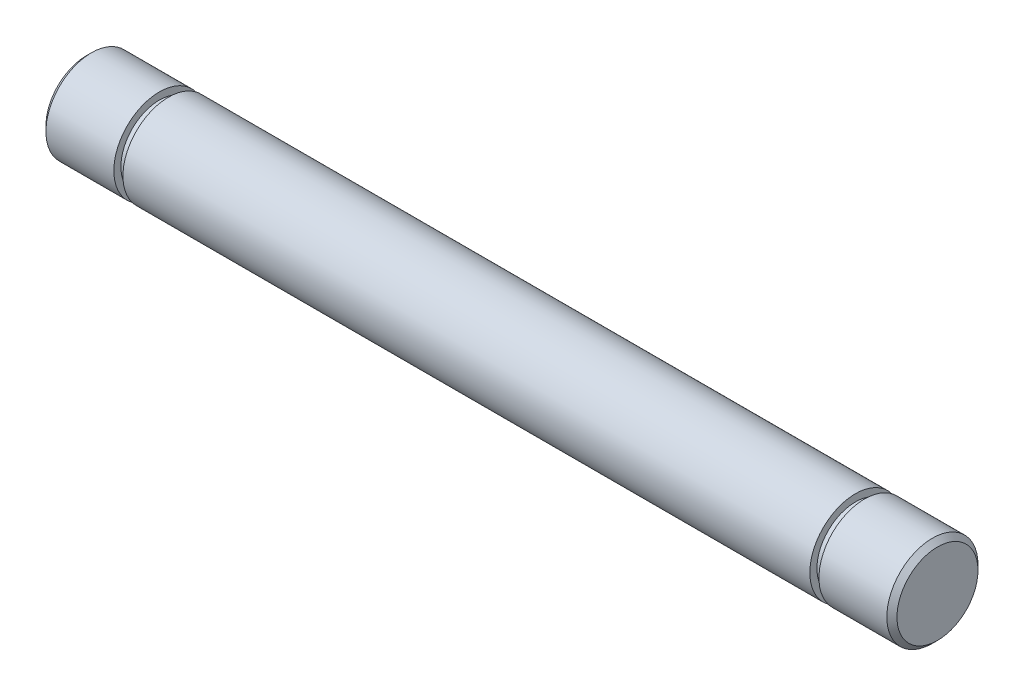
from build123d import *


with BuildPart() as part:
    # Esquisse1 → R_volution1 (revolve)
    with BuildSketch(Plane.XY, mode=Mode.PRIVATE) as r_volution1_sk:
        Polygon((0, 0), (84, 0), (84, 4), (83.5, 4.5), (76.8, 4.5), (76.8, 3.8), (75.9, 3.8), (75.9, 4.5), (8.1, 4.5), (8.1, 3.8), (7.2, 3.8), (7.2, 4.5), (0.5, 4.5), (0, 4), align=None)
    revolve(r_volution1_sk.sketch.rotate(Axis((124.297135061, 0, 0), (-1, 0, 0)), 90), axis=Axis((124.297135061, 0, 0), (-1, 0, 0)))


solid = part.part
